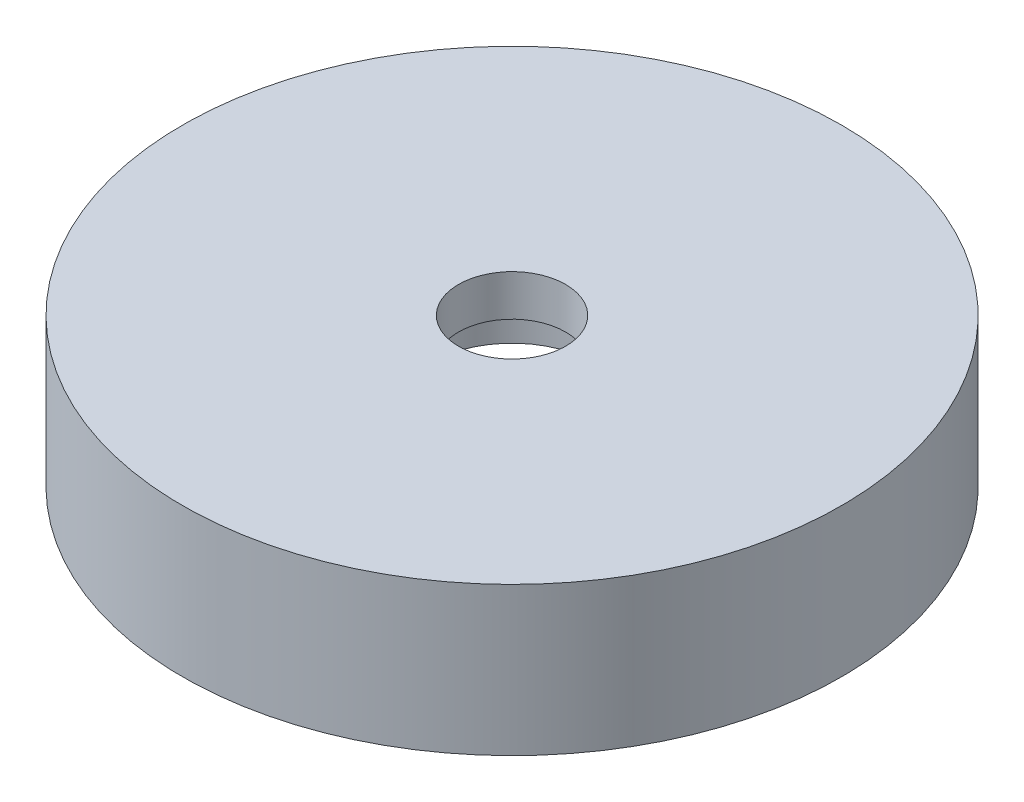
from build123d import *


with BuildPart() as part:
    # Esbo_o1 → Revolu_o1 (revolve)
    with BuildSketch(Plane.XY, mode=Mode.PRIVATE) as revolu_o1_sk:
        Polygon((3.25, 14), (3.25, 11.5), (5, 11.5), (5, 9), (17.5, 9), (17.5, 5), (20, 5), (20, 14), align=None)
    revolve(revolu_o1_sk.sketch.rotate(Axis((0, 0, 0), (0, 1, 0)), 90), axis=Axis((0, 0, 0), (0, 1, 0)))


solid = part.part
